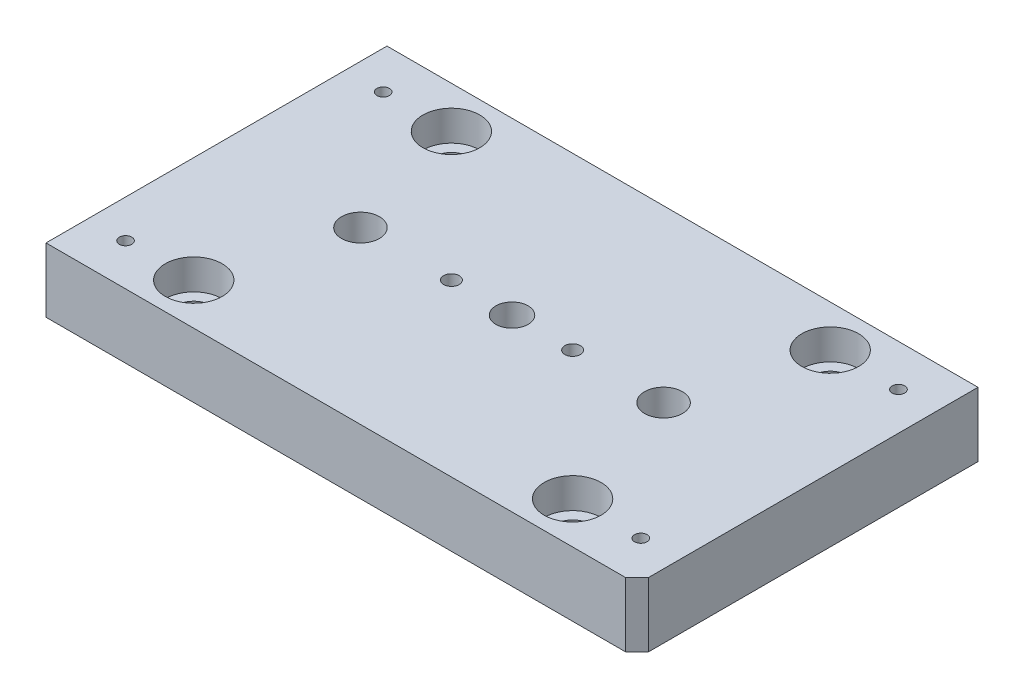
from build123d import *

# Parameters (mm, degrees)
ESQUISSE1_W                                     = 156
ESQUISSE1_H                                     = 90
EXTRUSION1_DEPTH                                = 17
TROU_TARAUD_M4X0_71_D                           = 3.3
TROU_TARAUD_M4X0_71_DEPTH                       = 10.1
TROU_TARAUD_M4X0_71_TIP                         = 0.991420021
CHAMBRAGE_POUR_VIS_T_TE_CYLINDRIQUE_D           = 9
CHAMBRAGE_POUR_VIS_T_TE_CYLINDRIQUE_CBORE_D     = 15
CHAMBRAGE_POUR_VIS_T_TE_CYLINDRIQUE_CBORE_DEPTH = 8
ESQUISSE6_R                                     = 2.05
ENL_V_MAT_EXTRU_1_DEPTH                         = 92.640602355
TROU_TARAUD_M10X1_51_D                          = 8.5
TROU_TARAUD_M10X1_51_ON_FACE_2_D                = 8.5
ESQUISSE8_R                                     = 4.5
ENL_V_MAT_EXTRU_2_DEPTH                         = 8
ESQUISSE9_R                                     = 6.75
ENL_V_MAT_EXTRU_5_DEPTH                         = 4
CHANFREIN_D_SIZE                                = 3
ESQUISSE10_R                                    = 5
ENL_V_MAT_EXTRU_6_DEPTH                         = 92.640602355


with BuildPart() as part:
    # Esquisse1 → Extrusion1 (new body)
    with BuildSketch(Plane(origin=(0, 0, 0), x_dir=(1, 0, 0), z_dir=(0, 1, 0))):
        Rectangle(ESQUISSE1_W, ESQUISSE1_H)
    extrude(amount=EXTRUSION1_DEPTH)

    # Trou taraud_ M4x0.71
    with Locations(Plane(origin=(0, 17, 0), x_dir=(-1, 0, 0), z_dir=(0, 1, 0))):
        with Locations((-68, 34), (-68, -34), (68, -34), (68, 34)):
            Hole(TROU_TARAUD_M4X0_71_D / 2, depth=TROU_TARAUD_M4X0_71_DEPTH)
            with Locations((0, 0, -(TROU_TARAUD_M4X0_71_DEPTH + TROU_TARAUD_M4X0_71_TIP / 2))):  # 118° drill point
                Cone(0, TROU_TARAUD_M4X0_71_D / 2, TROU_TARAUD_M4X0_71_TIP, mode=Mode.SUBTRACT)

    # Chambrage pour vis _ t_te cylindrique (through all)
    with Locations(Plane(origin=(0, 17, 0), x_dir=(-1, 0, 0), z_dir=(0, 1, 0))):
        with Locations((-50, 34), (-50, -34), (50, -34), (50, 34)):
            CounterBoreHole(CHAMBRAGE_POUR_VIS_T_TE_CYLINDRIQUE_D / 2, CHAMBRAGE_POUR_VIS_T_TE_CYLINDRIQUE_CBORE_D / 2, CHAMBRAGE_POUR_VIS_T_TE_CYLINDRIQUE_CBORE_DEPTH)

    # Esquisse6 → Enl_v. mat.-Extru.1 (cut, through all)
    with BuildSketch(Plane(origin=(0, 17, 0), x_dir=(-1, 0, 0), z_dir=(0, 1, 0))):
        with Locations(Location((-16, 0, 0), (0, 0, 90))):
            Circle(ESQUISSE6_R)
        with Locations(Location((16, 0, 0), (0, 0, 90))):
            Circle(ESQUISSE6_R)
    extrude(amount=-ENL_V_MAT_EXTRU_1_DEPTH, mode=Mode.SUBTRACT)

    # Trou taraud_ M10x1.51 (through all)
    with Locations(Plane(origin=(0, 0, 0), x_dir=(0, 0, -1), z_dir=(0, -1, 0))):
        with Locations((0, 0)):
            Hole(TROU_TARAUD_M10X1_51_D / 2)

    # Trou taraud_ M10x1.51 on face 2 (through all)
    with Locations(Plane.ZX.offset(17)):
        with Locations((0, 0)):
            Hole(TROU_TARAUD_M10X1_51_ON_FACE_2_D / 2)

    # Esquisse8 → Enl_v. mat.-Extru.2 (cut)
    with BuildSketch(Plane.XZ):
        with Locations(Location((16, 0, 0), (0, 0, 270))):
            Circle(ESQUISSE8_R)
        with Locations(Location((-16, 0, 0), (0, 0, 270))):
            Circle(ESQUISSE8_R)
    extrude(amount=-ENL_V_MAT_EXTRU_2_DEPTH, mode=Mode.SUBTRACT)

    # Esquisse9 → Enl_v. mat.-Extru.5 (cut)
    with BuildSketch(Plane.XZ):
        with Locations(Location((0, 0, 0), (0, 0, 270))):
            Circle(ESQUISSE9_R)
    extrude(amount=-ENL_V_MAT_EXTRU_5_DEPTH, mode=Mode.SUBTRACT)

    # Chanfrein_D
    chanfrein_d_edges = [part.edges().sort_by_distance(p)[0] for p in [
        (78, 8.5, 45),
    ]]
    chamfer(chanfrein_d_edges, length=CHANFREIN_D_SIZE)

    # Esquisse10 → Enl_v. mat.-Extru.6 (cut, through all)
    with BuildSketch(Plane.XZ):
        with Locations(Location((40, 0, 0), (0, 0, 270))):
            Circle(ESQUISSE10_R)
        with Locations(Location((-40, 0, 0), (0, 0, 270))):
            Circle(ESQUISSE10_R)
    extrude(amount=-ENL_V_MAT_EXTRU_6_DEPTH, mode=Mode.SUBTRACT)


solid = part.part
